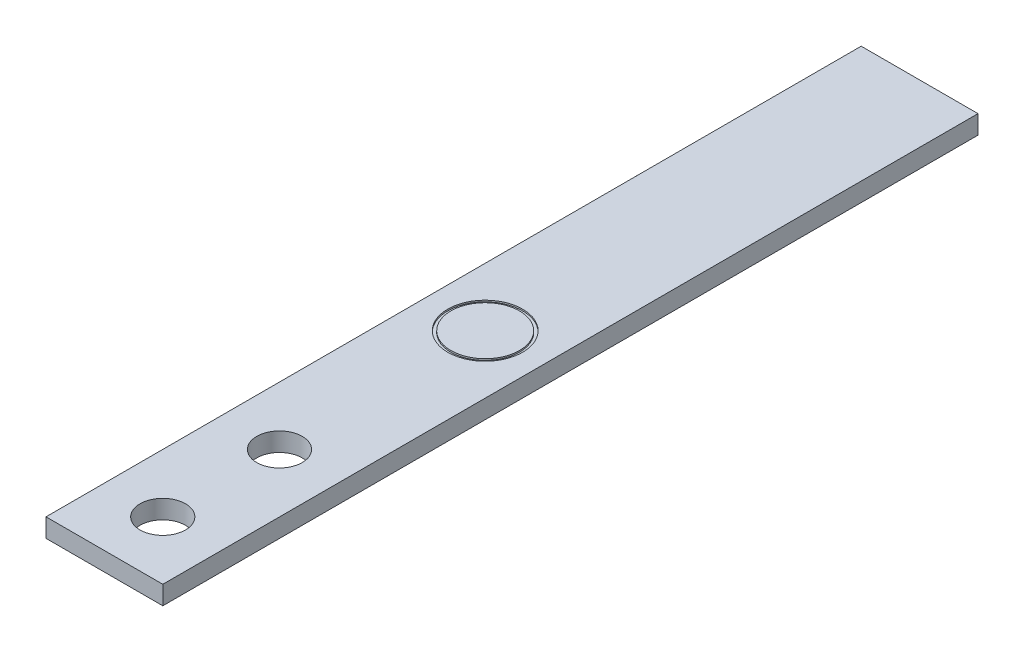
ISO-10303-21;
HEADER;
FILE_DESCRIPTION(('STEP AP214'),'2;1');
FILE_NAME('part.step','',(''),(''),'','','');
FILE_SCHEMA(('AUTOMOTIVE_DESIGN { 1 0 10303 214 1 1 1 1 }'));
ENDSEC;
DATA;
#1=APPLICATION_CONTEXT('core data for automotive mechanical design processes');
#2=APPLICATION_PROTOCOL_DEFINITION('international standard','automotive_design',2000,#1);
#3=PRODUCT_CONTEXT('',#1,'mechanical');
#4=PRODUCT('Part','Part','',(#3));
#5=PRODUCT_RELATED_PRODUCT_CATEGORY('part','',(#4));
#6=PRODUCT_DEFINITION_FORMATION('','',#4);
#7=PRODUCT_DEFINITION_CONTEXT('part definition',#1,'design');
#8=PRODUCT_DEFINITION('design','',#6,#7);
#9=PRODUCT_DEFINITION_SHAPE('','',#8);
#10=(LENGTH_UNIT() NAMED_UNIT(*) SI_UNIT(.MILLI.,.METRE.));
#11=(NAMED_UNIT(*) PLANE_ANGLE_UNIT() SI_UNIT($,.RADIAN.));
#12=(NAMED_UNIT(*) SI_UNIT($,.STERADIAN.) SOLID_ANGLE_UNIT());
#13=UNCERTAINTY_MEASURE_WITH_UNIT(LENGTH_MEASURE(1.E-05),#10,'distance_accuracy_value','');
#14=(GEOMETRIC_REPRESENTATION_CONTEXT(3) GLOBAL_UNCERTAINTY_ASSIGNED_CONTEXT((#13)) GLOBAL_UNIT_ASSIGNED_CONTEXT((#10,
#11,#12)) REPRESENTATION_CONTEXT('',''));
#15=CARTESIAN_POINT('',(0.,0.,0.));
#16=DIRECTION('',(0.,0.,1.));
#17=DIRECTION('',(1.,0.,0.));
#18=AXIS2_PLACEMENT_3D('',#15,#16,#17);
#19=CARTESIAN_POINT('',(4.76631,-1.524,9.525));
#20=DIRECTION('',(1.,0.,0.));
#21=DIRECTION('',(0.,0.,-1.));
#22=AXIS2_PLACEMENT_3D('',#19,#20,#21);
#23=PLANE('',#22);
#24=DIRECTION('',(0.,0.,-1.));
#25=VECTOR('',#24,1.);
#26=CARTESIAN_POINT('',(4.76631,0.,9.525));
#27=LINE('',#26,#25);
#28=CARTESIAN_POINT('',(4.76631,0.,9.525));
#29=VERTEX_POINT('',#28);
#30=CARTESIAN_POINT('',(4.76631,0.,-56.9976));
#31=VERTEX_POINT('',#30);
#32=EDGE_CURVE('E97',#29,#31,#27,.T.);
#33=ORIENTED_EDGE('',*,*,#32,.F.);
#34=DIRECTION('',(0.,1.,0.));
#35=VECTOR('',#34,1.);
#36=CARTESIAN_POINT('',(4.76631,-1.524,9.525));
#37=LINE('',#36,#35);
#38=CARTESIAN_POINT('',(4.76631,-1.524,9.525));
#39=VERTEX_POINT('',#38);
#40=EDGE_CURVE('E11',#39,#29,#37,.T.);
#41=ORIENTED_EDGE('',*,*,#40,.F.);
#42=DIRECTION('',(0.,0.,-1.));
#43=VECTOR('',#42,1.);
#44=CARTESIAN_POINT('',(4.76631,-1.524,-9.525));
#45=LINE('',#44,#43);
#46=CARTESIAN_POINT('',(4.76631,-1.524,-56.9976));
#47=VERTEX_POINT('',#46);
#48=EDGE_CURVE('E56',#39,#47,#45,.T.);
#49=ORIENTED_EDGE('',*,*,#48,.T.);
#50=DIRECTION('',(0.,1.,0.));
#51=VECTOR('',#50,1.);
#52=CARTESIAN_POINT('',(4.76631,-1.524,-56.9976));
#53=LINE('',#52,#51);
#54=EDGE_CURVE('E41',#47,#31,#53,.T.);
#55=ORIENTED_EDGE('',*,*,#54,.T.);
#56=EDGE_LOOP('',(#33,#41,#49,#55));
#57=FACE_BOUND('',#56,.T.);
#58=ADVANCED_FACE('F37',(#57),#23,.T.);
#59=CARTESIAN_POINT('',(-4.76631,-1.524,9.525));
#60=DIRECTION('',(0.,0.,1.));
#61=DIRECTION('',(1.,0.,0.));
#62=AXIS2_PLACEMENT_3D('',#59,#60,#61);
#63=PLANE('',#62);
#64=DIRECTION('',(1.,0.,0.));
#65=VECTOR('',#64,1.);
#66=CARTESIAN_POINT('',(-4.76631,0.,9.525));
#67=LINE('',#66,#65);
#68=CARTESIAN_POINT('',(-4.76631,0.,9.525));
#69=VERTEX_POINT('',#68);
#70=EDGE_CURVE('E106',#69,#29,#67,.T.);
#71=ORIENTED_EDGE('',*,*,#70,.F.);
#72=DIRECTION('',(0.,1.,0.));
#73=VECTOR('',#72,1.);
#74=CARTESIAN_POINT('',(-4.76631,-1.524,9.525));
#75=LINE('',#74,#73);
#76=CARTESIAN_POINT('',(-4.76631,-1.524,9.525));
#77=VERTEX_POINT('',#76);
#78=EDGE_CURVE('E47',#77,#69,#75,.T.);
#79=ORIENTED_EDGE('',*,*,#78,.F.);
#80=DIRECTION('',(1.,0.,0.));
#81=VECTOR('',#80,1.);
#82=CARTESIAN_POINT('',(-4.76631,-1.524,9.525));
#83=LINE('',#82,#81);
#84=EDGE_CURVE('E94',#77,#39,#83,.T.);
#85=ORIENTED_EDGE('',*,*,#84,.T.);
#86=ORIENTED_EDGE('',*,*,#40,.T.);
#87=EDGE_LOOP('',(#71,#79,#85,#86));
#88=FACE_BOUND('',#87,.T.);
#89=ADVANCED_FACE('F113',(#88),#63,.T.);
#90=CARTESIAN_POINT('',(-4.76631,-1.524,9.525));
#91=DIRECTION('',(-1.,0.,0.));
#92=DIRECTION('',(0.,0.,1.));
#93=AXIS2_PLACEMENT_3D('',#90,#91,#92);
#94=PLANE('',#93);
#95=DIRECTION('',(0.,0.,1.));
#96=VECTOR('',#95,1.);
#97=CARTESIAN_POINT('',(-4.76631,0.,9.525));
#98=LINE('',#97,#96);
#99=CARTESIAN_POINT('',(-4.76631,0.,-56.9976));
#100=VERTEX_POINT('',#99);
#101=EDGE_CURVE('E90',#100,#69,#98,.T.);
#102=ORIENTED_EDGE('',*,*,#101,.F.);
#103=DIRECTION('',(0.,1.,0.));
#104=VECTOR('',#103,1.);
#105=CARTESIAN_POINT('',(-4.76631,-1.524,-56.9976));
#106=LINE('',#105,#104);
#107=CARTESIAN_POINT('',(-4.76631,-1.524,-56.9976));
#108=VERTEX_POINT('',#107);
#109=EDGE_CURVE('E85',#108,#100,#106,.T.);
#110=ORIENTED_EDGE('',*,*,#109,.F.);
#111=DIRECTION('',(0.,0.,1.));
#112=VECTOR('',#111,1.);
#113=CARTESIAN_POINT('',(-4.76631,-1.524,-9.525));
#114=LINE('',#113,#112);
#115=EDGE_CURVE('E88',#108,#77,#114,.T.);
#116=ORIENTED_EDGE('',*,*,#115,.T.);
#117=ORIENTED_EDGE('',*,*,#78,.T.);
#118=EDGE_LOOP('',(#102,#110,#116,#117));
#119=FACE_BOUND('',#118,.T.);
#120=ADVANCED_FACE('F87',(#119),#94,.T.);
#121=CARTESIAN_POINT('',(-4.76631,-1.524,-56.9976));
#122=DIRECTION('',(0.,0.,-1.));
#123=DIRECTION('',(-1.,0.,0.));
#124=AXIS2_PLACEMENT_3D('',#121,#122,#123);
#125=PLANE('',#124);
#126=DIRECTION('',(-1.,0.,0.));
#127=VECTOR('',#126,1.);
#128=CARTESIAN_POINT('',(-4.76631,0.,-56.9976));
#129=LINE('',#128,#127);
#130=EDGE_CURVE('E102',#31,#100,#129,.T.);
#131=ORIENTED_EDGE('',*,*,#130,.F.);
#132=ORIENTED_EDGE('',*,*,#54,.F.);
#133=DIRECTION('',(-1.,0.,0.));
#134=VECTOR('',#133,1.);
#135=CARTESIAN_POINT('',(-4.76631,-1.524,-56.9976));
#136=LINE('',#135,#134);
#137=EDGE_CURVE('E93',#47,#108,#136,.T.);
#138=ORIENTED_EDGE('',*,*,#137,.T.);
#139=ORIENTED_EDGE('',*,*,#109,.T.);
#140=EDGE_LOOP('',(#131,#132,#138,#139));
#141=FACE_BOUND('',#140,.T.);
#142=ADVANCED_FACE('F39',(#141),#125,.T.);
#143=CARTESIAN_POINT('',(0.,-1.524,0.));
#144=DIRECTION('',(0.,-1.,0.));
#145=DIRECTION('',(0.,0.,-1.));
#146=AXIS2_PLACEMENT_3D('',#143,#144,#145);
#147=PLANE('',#146);
#148=CARTESIAN_POINT('',(0.,-1.524,4.7625));
#149=DIRECTION('',(0.,1.,0.));
#150=DIRECTION('',(0.,0.,-1.));
#151=AXIS2_PLACEMENT_3D('',#148,#149,#150);
#152=CIRCLE('',#151,1.8542);
#153=CARTESIAN_POINT('',(0.,-1.524,6.6167));
#154=VERTEX_POINT('',#153);
#155=EDGE_CURVE('E162',#154,#154,#152,.T.);
#156=ORIENTED_EDGE('',*,*,#155,.T.);
#157=EDGE_LOOP('',(#156));
#158=FACE_BOUND('',#157,.T.);
#159=CARTESIAN_POINT('',(0.,-1.524,-4.7625));
#160=DIRECTION('',(0.,1.,0.));
#161=DIRECTION('',(0.,0.,1.));
#162=AXIS2_PLACEMENT_3D('',#159,#160,#161);
#163=CIRCLE('',#162,1.8542);
#164=CARTESIAN_POINT('',(0.,-1.524,-2.9083));
#165=VERTEX_POINT('',#164);
#166=EDGE_CURVE('E104',#165,#165,#163,.T.);
#167=ORIENTED_EDGE('',*,*,#166,.T.);
#168=EDGE_LOOP('',(#167));
#169=FACE_BOUND('',#168,.T.);
#170=ORIENTED_EDGE('',*,*,#48,.F.);
#171=ORIENTED_EDGE('',*,*,#84,.F.);
#172=ORIENTED_EDGE('',*,*,#115,.F.);
#173=ORIENTED_EDGE('',*,*,#137,.F.);
#174=EDGE_LOOP('',(#170,#171,#172,#173));
#175=FACE_BOUND('',#174,.T.);
#176=ADVANCED_FACE('F92',(#158,#169,#175),#147,.T.);
#177=CARTESIAN_POINT('',(0.,0.,0.));
#178=DIRECTION('',(0.,-1.,0.));
#179=DIRECTION('',(0.,0.,-1.));
#180=AXIS2_PLACEMENT_3D('',#177,#178,#179);
#181=PLANE('',#180);
#182=CARTESIAN_POINT('',(0.,0.,-21.5477613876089));
#183=DIRECTION('',(0.,1.,0.));
#184=DIRECTION('',(0.,0.,1.));
#185=AXIS2_PLACEMENT_3D('',#182,#183,#184);
#186=CIRCLE('',#185,3.05413135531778);
#187=CARTESIAN_POINT('',(0.,0.,-18.4936300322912));
#188=VERTEX_POINT('',#187);
#189=EDGE_CURVE('E164',#188,#188,#186,.T.);
#190=ORIENTED_EDGE('',*,*,#189,.F.);
#191=EDGE_LOOP('',(#190));
#192=FACE_BOUND('',#191,.T.);
#193=CARTESIAN_POINT('',(0.,0.,4.7625));
#194=DIRECTION('',(0.,1.,0.));
#195=DIRECTION('',(0.,0.,-1.));
#196=AXIS2_PLACEMENT_3D('',#193,#194,#195);
#197=CIRCLE('',#196,1.8542);
#198=CARTESIAN_POINT('',(0.,0.,6.6167));
#199=VERTEX_POINT('',#198);
#200=EDGE_CURVE('E159',#199,#199,#197,.T.);
#201=ORIENTED_EDGE('',*,*,#200,.F.);
#202=EDGE_LOOP('',(#201));
#203=FACE_BOUND('',#202,.T.);
#204=CARTESIAN_POINT('',(0.,0.,-4.7625));
#205=DIRECTION('',(0.,1.,0.));
#206=DIRECTION('',(0.,0.,1.));
#207=AXIS2_PLACEMENT_3D('',#204,#205,#206);
#208=CIRCLE('',#207,1.8542);
#209=CARTESIAN_POINT('',(0.,0.,-2.9083));
#210=VERTEX_POINT('',#209);
#211=EDGE_CURVE('E173',#210,#210,#208,.T.);
#212=ORIENTED_EDGE('',*,*,#211,.F.);
#213=EDGE_LOOP('',(#212));
#214=FACE_BOUND('',#213,.T.);
#215=ORIENTED_EDGE('',*,*,#32,.T.);
#216=ORIENTED_EDGE('',*,*,#130,.T.);
#217=ORIENTED_EDGE('',*,*,#101,.T.);
#218=ORIENTED_EDGE('',*,*,#70,.T.);
#219=EDGE_LOOP('',(#215,#216,#217,#218));
#220=FACE_BOUND('',#219,.T.);
#221=ADVANCED_FACE('F111',(#192,#203,#214,#220),#181,.F.);
#222=CARTESIAN_POINT('',(0.,-1.524,-4.7625));
#223=DIRECTION('',(0.,1.,0.));
#224=DIRECTION('',(0.,0.,1.));
#225=AXIS2_PLACEMENT_3D('',#222,#223,#224);
#226=CYLINDRICAL_SURFACE('',#225,1.8542);
#227=CARTESIAN_POINT('',(0.,-1.524,-2.9083));
#228=CARTESIAN_POINT('',(0.,-1.508125,-2.9083));
#229=CARTESIAN_POINT('',(0.,-1.49225,-2.9083));
#230=CARTESIAN_POINT('',(0.,-1.4605,-2.9083));
#231=CARTESIAN_POINT('',(0.,-1.444625,-2.9083));
#232=CARTESIAN_POINT('',(0.,-1.412875,-2.9083));
#233=CARTESIAN_POINT('',(0.,-1.397,-2.9083));
#234=CARTESIAN_POINT('',(0.,-1.36525,-2.9083));
#235=CARTESIAN_POINT('',(0.,-1.349375,-2.9083));
#236=CARTESIAN_POINT('',(0.,-1.317625,-2.9083));
#237=CARTESIAN_POINT('',(0.,-1.30175,-2.9083));
#238=CARTESIAN_POINT('',(0.,-1.27,-2.9083));
#239=CARTESIAN_POINT('',(0.,-1.254125,-2.9083));
#240=CARTESIAN_POINT('',(0.,-1.222375,-2.9083));
#241=CARTESIAN_POINT('',(0.,-1.2065,-2.9083));
#242=CARTESIAN_POINT('',(0.,-1.17475,-2.9083));
#243=CARTESIAN_POINT('',(0.,-1.158875,-2.9083));
#244=CARTESIAN_POINT('',(0.,-1.127125,-2.9083));
#245=CARTESIAN_POINT('',(0.,-1.11125,-2.9083));
#246=CARTESIAN_POINT('',(0.,-1.0795,-2.9083));
#247=CARTESIAN_POINT('',(0.,-1.063625,-2.9083));
#248=CARTESIAN_POINT('',(0.,-1.031875,-2.9083));
#249=CARTESIAN_POINT('',(0.,-1.016,-2.9083));
#250=CARTESIAN_POINT('',(0.,-0.98425,-2.9083));
#251=CARTESIAN_POINT('',(0.,-0.968375,-2.9083));
#252=CARTESIAN_POINT('',(0.,-0.936625,-2.9083));
#253=CARTESIAN_POINT('',(0.,-0.92075,-2.9083));
#254=CARTESIAN_POINT('',(0.,-0.889,-2.9083));
#255=CARTESIAN_POINT('',(0.,-0.873125,-2.9083));
#256=CARTESIAN_POINT('',(0.,-0.841375,-2.9083));
#257=CARTESIAN_POINT('',(0.,-0.8255,-2.9083));
#258=CARTESIAN_POINT('',(0.,-0.79375,-2.9083));
#259=CARTESIAN_POINT('',(0.,-0.777875,-2.9083));
#260=CARTESIAN_POINT('',(0.,-0.746125,-2.9083));
#261=CARTESIAN_POINT('',(0.,-0.73025,-2.9083));
#262=CARTESIAN_POINT('',(0.,-0.6985,-2.9083));
#263=CARTESIAN_POINT('',(0.,-0.682625,-2.9083));
#264=CARTESIAN_POINT('',(0.,-0.650875,-2.9083));
#265=CARTESIAN_POINT('',(0.,-0.635,-2.9083));
#266=CARTESIAN_POINT('',(0.,-0.60325,-2.9083));
#267=CARTESIAN_POINT('',(0.,-0.587375,-2.9083));
#268=CARTESIAN_POINT('',(0.,-0.555625,-2.9083));
#269=CARTESIAN_POINT('',(0.,-0.53975,-2.9083));
#270=CARTESIAN_POINT('',(0.,-0.508,-2.9083));
#271=CARTESIAN_POINT('',(0.,-0.492125,-2.9083));
#272=CARTESIAN_POINT('',(0.,-0.460375,-2.9083));
#273=CARTESIAN_POINT('',(0.,-0.4445,-2.9083));
#274=CARTESIAN_POINT('',(0.,-0.41275,-2.9083));
#275=CARTESIAN_POINT('',(0.,-0.396875,-2.9083));
#276=CARTESIAN_POINT('',(0.,-0.365125,-2.9083));
#277=CARTESIAN_POINT('',(0.,-0.34925,-2.9083));
#278=CARTESIAN_POINT('',(0.,-0.3175,-2.9083));
#279=CARTESIAN_POINT('',(0.,-0.301625,-2.9083));
#280=CARTESIAN_POINT('',(0.,-0.269875,-2.9083));
#281=CARTESIAN_POINT('',(0.,-0.254,-2.9083));
#282=CARTESIAN_POINT('',(0.,-0.22225,-2.9083));
#283=CARTESIAN_POINT('',(0.,-0.206375,-2.9083));
#284=CARTESIAN_POINT('',(0.,-0.174625,-2.9083));
#285=CARTESIAN_POINT('',(0.,-0.15875,-2.9083));
#286=CARTESIAN_POINT('',(0.,-0.127,-2.9083));
#287=CARTESIAN_POINT('',(0.,-0.111125,-2.9083));
#288=CARTESIAN_POINT('',(0.,-0.079375,-2.9083));
#289=CARTESIAN_POINT('',(0.,-0.0635,-2.9083));
#290=CARTESIAN_POINT('',(0.,-0.0317499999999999,-2.9083));
#291=CARTESIAN_POINT('',(0.,-0.015875,-2.9083));
#292=CARTESIAN_POINT('',(0.,0.,-2.9083));
#293=B_SPLINE_CURVE_WITH_KNOTS('',3,(#227,#228,#229,#230,#231,#232,#233,#234,#235,#236,#237,
#238,#239,#240,#241,#242,#243,#244,#245,#246,#247,#248,#249,#250,#251,#252,#253,#254,#255,#256,
#257,#258,#259,#260,#261,#262,#263,#264,#265,#266,#267,#268,#269,#270,#271,#272,#273,#274,#275,
#276,#277,#278,#279,#280,#281,#282,#283,#284,#285,#286,#287,#288,#289,#290,#291,#292),
.UNSPECIFIED.,.F.,.F.,(4,2,2,2,2,2,2,2,2,2,2,2,2,2,2,2,2,2,2,2,2,2,2,2,2,2,2,2,2,2,2,2,4),(0.,
0.0476249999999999,0.0952499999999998,0.142875,0.1905,0.238125,0.28575,0.333375,0.381,0.428625,
0.47625,0.523875,0.5715,0.619125,0.66675,0.714375,0.762,0.809625,0.85725,0.904875,0.9525,
1.000125,1.04775,1.095375,1.143,1.190625,1.23825,1.285875,1.3335,1.381125,1.42875,1.476375,
1.524),.UNSPECIFIED.);
#294=EDGE_CURVE('BSEAM124',#165,#210,#293,.T.);
#295=ORIENTED_EDGE('',*,*,#166,.F.);
#296=ORIENTED_EDGE('',*,*,#211,.T.);
#297=ORIENTED_EDGE('',*,*,#294,.T.);
#298=ORIENTED_EDGE('',*,*,#294,.F.);
#299=EDGE_LOOP('',(#295,#297,#296,#298));
#300=FACE_BOUND('',#299,.T.);
#301=ADVANCED_FACE('F124',(#300),#226,.F.);
#302=CARTESIAN_POINT('',(0.,-1.524,4.7625));
#303=DIRECTION('',(0.,1.,0.));
#304=DIRECTION('',(0.,0.,1.));
#305=AXIS2_PLACEMENT_3D('',#302,#303,#304);
#306=CYLINDRICAL_SURFACE('',#305,1.8542);
#307=CARTESIAN_POINT('',(0.,-1.524,6.6167));
#308=CARTESIAN_POINT('',(0.,-1.508125,6.6167));
#309=CARTESIAN_POINT('',(0.,-1.49225,6.6167));
#310=CARTESIAN_POINT('',(0.,-1.4605,6.6167));
#311=CARTESIAN_POINT('',(0.,-1.444625,6.6167));
#312=CARTESIAN_POINT('',(0.,-1.412875,6.6167));
#313=CARTESIAN_POINT('',(0.,-1.397,6.6167));
#314=CARTESIAN_POINT('',(0.,-1.36525,6.6167));
#315=CARTESIAN_POINT('',(0.,-1.349375,6.6167));
#316=CARTESIAN_POINT('',(0.,-1.317625,6.6167));
#317=CARTESIAN_POINT('',(0.,-1.30175,6.6167));
#318=CARTESIAN_POINT('',(0.,-1.27,6.6167));
#319=CARTESIAN_POINT('',(0.,-1.254125,6.6167));
#320=CARTESIAN_POINT('',(0.,-1.222375,6.6167));
#321=CARTESIAN_POINT('',(0.,-1.2065,6.6167));
#322=CARTESIAN_POINT('',(0.,-1.17475,6.6167));
#323=CARTESIAN_POINT('',(0.,-1.158875,6.6167));
#324=CARTESIAN_POINT('',(0.,-1.127125,6.6167));
#325=CARTESIAN_POINT('',(0.,-1.11125,6.6167));
#326=CARTESIAN_POINT('',(0.,-1.0795,6.6167));
#327=CARTESIAN_POINT('',(0.,-1.063625,6.6167));
#328=CARTESIAN_POINT('',(0.,-1.031875,6.6167));
#329=CARTESIAN_POINT('',(0.,-1.016,6.6167));
#330=CARTESIAN_POINT('',(0.,-0.98425,6.6167));
#331=CARTESIAN_POINT('',(0.,-0.968375,6.6167));
#332=CARTESIAN_POINT('',(0.,-0.936625,6.6167));
#333=CARTESIAN_POINT('',(0.,-0.92075,6.6167));
#334=CARTESIAN_POINT('',(0.,-0.889,6.6167));
#335=CARTESIAN_POINT('',(0.,-0.873125,6.6167));
#336=CARTESIAN_POINT('',(0.,-0.841375,6.6167));
#337=CARTESIAN_POINT('',(0.,-0.8255,6.6167));
#338=CARTESIAN_POINT('',(0.,-0.79375,6.6167));
#339=CARTESIAN_POINT('',(0.,-0.777875,6.6167));
#340=CARTESIAN_POINT('',(0.,-0.746125,6.6167));
#341=CARTESIAN_POINT('',(0.,-0.73025,6.6167));
#342=CARTESIAN_POINT('',(0.,-0.6985,6.6167));
#343=CARTESIAN_POINT('',(0.,-0.682625,6.6167));
#344=CARTESIAN_POINT('',(0.,-0.650875,6.6167));
#345=CARTESIAN_POINT('',(0.,-0.635,6.6167));
#346=CARTESIAN_POINT('',(0.,-0.60325,6.6167));
#347=CARTESIAN_POINT('',(0.,-0.587375,6.6167));
#348=CARTESIAN_POINT('',(0.,-0.555625,6.6167));
#349=CARTESIAN_POINT('',(0.,-0.53975,6.6167));
#350=CARTESIAN_POINT('',(0.,-0.508,6.6167));
#351=CARTESIAN_POINT('',(0.,-0.492125,6.6167));
#352=CARTESIAN_POINT('',(0.,-0.460375,6.6167));
#353=CARTESIAN_POINT('',(0.,-0.4445,6.6167));
#354=CARTESIAN_POINT('',(0.,-0.41275,6.6167));
#355=CARTESIAN_POINT('',(0.,-0.396875,6.6167));
#356=CARTESIAN_POINT('',(0.,-0.365125,6.6167));
#357=CARTESIAN_POINT('',(0.,-0.34925,6.6167));
#358=CARTESIAN_POINT('',(0.,-0.3175,6.6167));
#359=CARTESIAN_POINT('',(0.,-0.301625,6.6167));
#360=CARTESIAN_POINT('',(0.,-0.269875,6.6167));
#361=CARTESIAN_POINT('',(0.,-0.254,6.6167));
#362=CARTESIAN_POINT('',(0.,-0.22225,6.6167));
#363=CARTESIAN_POINT('',(0.,-0.206375,6.6167));
#364=CARTESIAN_POINT('',(0.,-0.174625,6.6167));
#365=CARTESIAN_POINT('',(0.,-0.15875,6.6167));
#366=CARTESIAN_POINT('',(0.,-0.127,6.6167));
#367=CARTESIAN_POINT('',(0.,-0.111125,6.6167));
#368=CARTESIAN_POINT('',(0.,-0.079375,6.6167));
#369=CARTESIAN_POINT('',(0.,-0.0635,6.6167));
#370=CARTESIAN_POINT('',(0.,-0.0317499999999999,6.6167));
#371=CARTESIAN_POINT('',(0.,-0.015875,6.6167));
#372=CARTESIAN_POINT('',(0.,0.,6.6167));
#373=B_SPLINE_CURVE_WITH_KNOTS('',3,(#307,#308,#309,#310,#311,#312,#313,#314,#315,#316,#317,
#318,#319,#320,#321,#322,#323,#324,#325,#326,#327,#328,#329,#330,#331,#332,#333,#334,#335,#336,
#337,#338,#339,#340,#341,#342,#343,#344,#345,#346,#347,#348,#349,#350,#351,#352,#353,#354,#355,
#356,#357,#358,#359,#360,#361,#362,#363,#364,#365,#366,#367,#368,#369,#370,#371,#372),
.UNSPECIFIED.,.F.,.F.,(4,2,2,2,2,2,2,2,2,2,2,2,2,2,2,2,2,2,2,2,2,2,2,2,2,2,2,2,2,2,2,2,4),(0.,
0.0476249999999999,0.0952499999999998,0.142875,0.1905,0.238125,0.28575,0.333375,0.381,0.428625,
0.47625,0.523875,0.5715,0.619125,0.66675,0.714375,0.762,0.809625,0.85725,0.904875,0.9525,
1.000125,1.04775,1.095375,1.143,1.190625,1.23825,1.285875,1.3335,1.381125,1.42875,1.476375,
1.524),.UNSPECIFIED.);
#374=EDGE_CURVE('BSEAM132',#154,#199,#373,.T.);
#375=ORIENTED_EDGE('',*,*,#155,.F.);
#376=ORIENTED_EDGE('',*,*,#200,.T.);
#377=ORIENTED_EDGE('',*,*,#374,.T.);
#378=ORIENTED_EDGE('',*,*,#374,.F.);
#379=EDGE_LOOP('',(#375,#377,#376,#378));
#380=FACE_BOUND('',#379,.T.);
#381=ADVANCED_FACE('F132',(#380),#306,.F.);
#382=CARTESIAN_POINT('',(0.,-0.127,-21.5477613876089));
#383=DIRECTION('',(0.,1.,0.));
#384=DIRECTION('',(0.,0.,1.));
#385=AXIS2_PLACEMENT_3D('',#382,#383,#384);
#386=CYLINDRICAL_SURFACE('',#385,2.80013135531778);
#387=CARTESIAN_POINT('',(0.,-0.127,-21.5477613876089));
#388=DIRECTION('',(0.,1.,0.));
#389=DIRECTION('',(0.,0.,1.));
#390=AXIS2_PLACEMENT_3D('',#387,#388,#389);
#391=CIRCLE('',#390,2.80013135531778);
#392=CARTESIAN_POINT('',(0.,-0.127,-18.7476300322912));
#393=VERTEX_POINT('',#392);
#394=EDGE_CURVE('E155',#393,#393,#391,.T.);
#395=ORIENTED_EDGE('',*,*,#394,.T.);
#396=EDGE_LOOP('',(#395));
#397=FACE_BOUND('',#396,.T.);
#398=CARTESIAN_POINT('',(0.,0.,-21.5477613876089));
#399=DIRECTION('',(0.,1.,0.));
#400=DIRECTION('',(0.,0.,1.));
#401=AXIS2_PLACEMENT_3D('',#398,#399,#400);
#402=CIRCLE('',#401,2.80013135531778);
#403=CARTESIAN_POINT('',(0.,0.,-18.7476300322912));
#404=VERTEX_POINT('',#403);
#405=EDGE_CURVE('E167',#404,#404,#402,.T.);
#406=ORIENTED_EDGE('',*,*,#405,.F.);
#407=EDGE_LOOP('',(#406));
#408=FACE_BOUND('',#407,.T.);
#409=ADVANCED_FACE('F136',(#397,#408),#386,.T.);
#410=CARTESIAN_POINT('',(0.,-0.127,-21.5477613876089));
#411=DIRECTION('',(0.,1.,0.));
#412=DIRECTION('',(0.,0.,1.));
#413=AXIS2_PLACEMENT_3D('',#410,#411,#412);
#414=CYLINDRICAL_SURFACE('',#413,3.05413135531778);
#415=CARTESIAN_POINT('',(0.,-0.127,-21.5477613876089));
#416=DIRECTION('',(0.,1.,0.));
#417=DIRECTION('',(0.,0.,1.));
#418=AXIS2_PLACEMENT_3D('',#415,#416,#417);
#419=CIRCLE('',#418,3.05413135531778);
#420=CARTESIAN_POINT('',(0.,-0.127,-18.4936300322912));
#421=VERTEX_POINT('',#420);
#422=EDGE_CURVE('E158',#421,#421,#419,.T.);
#423=ORIENTED_EDGE('',*,*,#422,.F.);
#424=EDGE_LOOP('',(#423));
#425=FACE_BOUND('',#424,.T.);
#426=ORIENTED_EDGE('',*,*,#189,.T.);
#427=EDGE_LOOP('',(#426));
#428=FACE_BOUND('',#427,.T.);
#429=ADVANCED_FACE('F140',(#425,#428),#414,.F.);
#430=CARTESIAN_POINT('',(0.,-0.127,0.));
#431=DIRECTION('',(0.,1.,0.));
#432=DIRECTION('',(0.,0.,1.));
#433=AXIS2_PLACEMENT_3D('',#430,#431,#432);
#434=PLANE('',#433);
#435=ORIENTED_EDGE('',*,*,#394,.F.);
#436=EDGE_LOOP('',(#435));
#437=FACE_BOUND('',#436,.T.);
#438=ORIENTED_EDGE('',*,*,#422,.T.);
#439=EDGE_LOOP('',(#438));
#440=FACE_BOUND('',#439,.T.);
#441=ADVANCED_FACE('F144',(#437,#440),#434,.T.);
#442=ORIENTED_EDGE('',*,*,#405,.T.);
#443=EDGE_LOOP('',(#442));
#444=FACE_BOUND('',#443,.T.);
#445=ADVANCED_FACE('F126',(#444),#181,.F.);
#446=CLOSED_SHELL('',(#58,#89,#120,#142,#176,#221,#301,#381,#409,#429,#441,#445));
#447=MANIFOLD_SOLID_BREP('B2',#446);
#448=ADVANCED_BREP_SHAPE_REPRESENTATION('',(#18,#447),#14);
#449=SHAPE_DEFINITION_REPRESENTATION(#9,#448);
ENDSEC;
END-ISO-10303-21;
